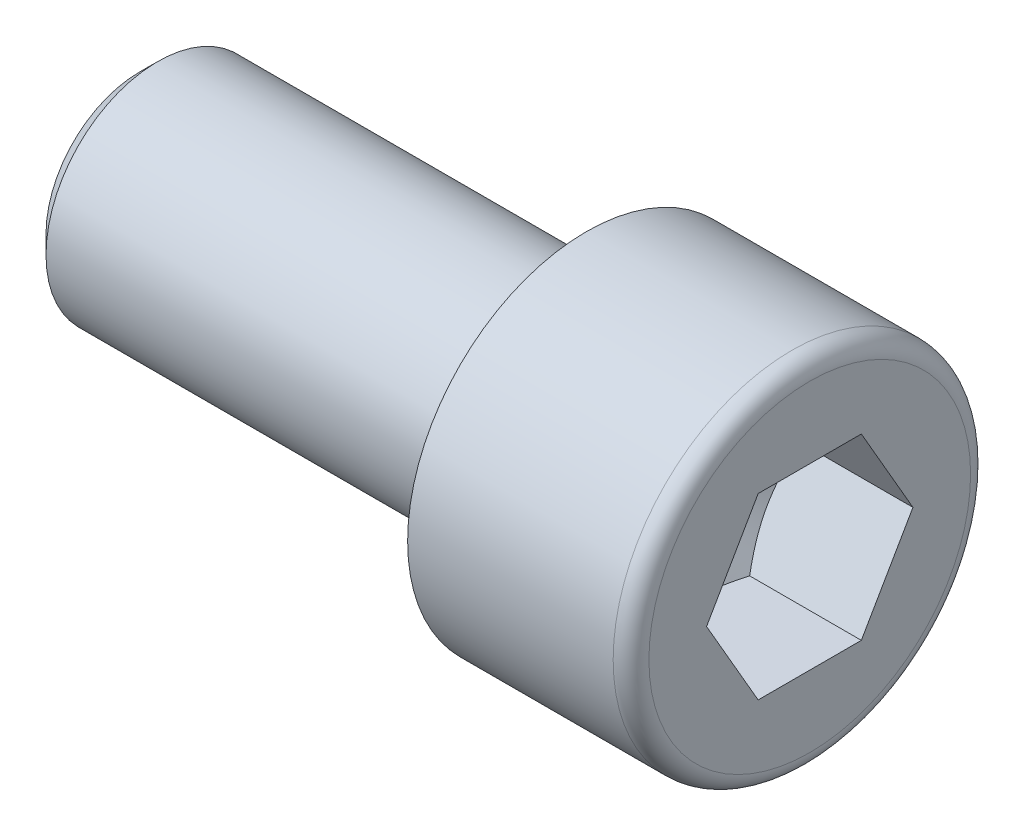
ISO-10303-21;
HEADER;
FILE_DESCRIPTION(('STEP AP214'),'2;1');
FILE_NAME('part.step','',(''),(''),'','','');
FILE_SCHEMA(('AUTOMOTIVE_DESIGN { 1 0 10303 214 1 1 1 1 }'));
ENDSEC;
DATA;
#1=APPLICATION_CONTEXT('core data for automotive mechanical design processes');
#2=APPLICATION_PROTOCOL_DEFINITION('international standard','automotive_design',2000,#1);
#3=PRODUCT_CONTEXT('',#1,'mechanical');
#4=PRODUCT('Part','Part','',(#3));
#5=PRODUCT_RELATED_PRODUCT_CATEGORY('part','',(#4));
#6=PRODUCT_DEFINITION_FORMATION('','',#4);
#7=PRODUCT_DEFINITION_CONTEXT('part definition',#1,'design');
#8=PRODUCT_DEFINITION('design','',#6,#7);
#9=PRODUCT_DEFINITION_SHAPE('','',#8);
#10=(LENGTH_UNIT() NAMED_UNIT(*) SI_UNIT(.MILLI.,.METRE.));
#11=(NAMED_UNIT(*) PLANE_ANGLE_UNIT() SI_UNIT($,.RADIAN.));
#12=(NAMED_UNIT(*) SI_UNIT($,.STERADIAN.) SOLID_ANGLE_UNIT());
#13=UNCERTAINTY_MEASURE_WITH_UNIT(LENGTH_MEASURE(1.E-05),#10,'distance_accuracy_value','');
#14=(GEOMETRIC_REPRESENTATION_CONTEXT(3) GLOBAL_UNCERTAINTY_ASSIGNED_CONTEXT((#13)) GLOBAL_UNIT_ASSIGNED_CONTEXT((#10,
#11,#12)) REPRESENTATION_CONTEXT('',''));
#15=CARTESIAN_POINT('',(0.,0.,0.));
#16=DIRECTION('',(0.,0.,1.));
#17=DIRECTION('',(1.,0.,0.));
#18=AXIS2_PLACEMENT_3D('',#15,#16,#17);
#19=CARTESIAN_POINT('',(-1.,17.,155.));
#20=DIRECTION('',(1.,0.,0.));
#21=DIRECTION('',(0.,0.,1.));
#22=AXIS2_PLACEMENT_3D('',#19,#20,#21);
#23=PLANE('',#22);
#24=CARTESIAN_POINT('',(-1.,17.,155.));
#25=DIRECTION('',(1.,0.,0.));
#26=DIRECTION('',(0.,0.,1.));
#27=AXIS2_PLACEMENT_3D('',#24,#25,#26);
#28=CIRCLE('',#27,7.2);
#29=CARTESIAN_POINT('',(-1.,17.,162.2));
#30=VERTEX_POINT('',#29);
#31=EDGE_CURVE('E11',#30,#30,#28,.T.);
#32=ORIENTED_EDGE('',*,*,#31,.T.);
#33=EDGE_LOOP('',(#32));
#34=FACE_BOUND('',#33,.T.);
#35=DIRECTION('',(0.,0.,1.));
#36=VECTOR('',#35,1.);
#37=CARTESIAN_POINT('',(-1.00000000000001,13.0000018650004,152.6906));
#38=LINE('',#37,#36);
#39=CARTESIAN_POINT('',(-1.00000000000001,13.0000018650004,152.6906));
#40=VERTEX_POINT('',#39);
#41=CARTESIAN_POINT('',(-1.,13.0000018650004,157.3094));
#42=VERTEX_POINT('',#41);
#43=EDGE_CURVE('E91',#40,#42,#38,.T.);
#44=ORIENTED_EDGE('',*,*,#43,.T.);
#45=DIRECTION('',(0.,0.866025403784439,0.5));
#46=VECTOR('',#45,1.);
#47=CARTESIAN_POINT('',(-1.,13.0000018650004,157.3094));
#48=LINE('',#47,#46);
#49=CARTESIAN_POINT('',(-0.999999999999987,17.,159.6188));
#50=VERTEX_POINT('',#49);
#51=EDGE_CURVE('E30',#42,#50,#48,.T.);
#52=ORIENTED_EDGE('',*,*,#51,.T.);
#53=DIRECTION('',(0.,0.866025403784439,-0.5));
#54=VECTOR('',#53,1.);
#55=CARTESIAN_POINT('',(-0.999999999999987,17.,159.6188));
#56=LINE('',#55,#54);
#57=CARTESIAN_POINT('',(-0.999999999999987,20.9999981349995,157.3094));
#58=VERTEX_POINT('',#57);
#59=EDGE_CURVE('E171',#50,#58,#56,.T.);
#60=ORIENTED_EDGE('',*,*,#59,.T.);
#61=DIRECTION('',(0.,0.,-1.));
#62=VECTOR('',#61,1.);
#63=CARTESIAN_POINT('',(-0.999999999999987,20.9999981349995,157.3094));
#64=LINE('',#63,#62);
#65=CARTESIAN_POINT('',(-1.,20.9999981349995,152.6906));
#66=VERTEX_POINT('',#65);
#67=EDGE_CURVE('E167',#58,#66,#64,.T.);
#68=ORIENTED_EDGE('',*,*,#67,.T.);
#69=DIRECTION('',(0.,-0.866025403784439,-0.5));
#70=VECTOR('',#69,1.);
#71=CARTESIAN_POINT('',(-1.,20.9999981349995,152.6906));
#72=LINE('',#71,#70);
#73=CARTESIAN_POINT('',(-1.00000000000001,17.,150.3812));
#74=VERTEX_POINT('',#73);
#75=EDGE_CURVE('E162',#66,#74,#72,.T.);
#76=ORIENTED_EDGE('',*,*,#75,.T.);
#77=DIRECTION('',(0.,-0.866025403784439,0.5));
#78=VECTOR('',#77,1.);
#79=CARTESIAN_POINT('',(-1.00000000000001,17.,150.3812));
#80=LINE('',#79,#78);
#81=EDGE_CURVE('E95',#74,#40,#80,.T.);
#82=ORIENTED_EDGE('',*,*,#81,.T.);
#83=EDGE_LOOP('',(#44,#52,#60,#68,#76,#82));
#84=FACE_BOUND('',#83,.T.);
#85=ADVANCED_FACE('F16',(#34,#84),#23,.T.);
#86=CARTESIAN_POINT('',(-1.8,17.,155.));
#87=DIRECTION('',(1.,0.,0.));
#88=DIRECTION('',(0.,0.,1.));
#89=AXIS2_PLACEMENT_3D('',#86,#87,#88);
#90=TOROIDAL_SURFACE('',#89,7.2,0.8);
#91=ORIENTED_EDGE('',*,*,#31,.F.);
#92=EDGE_LOOP('',(#91));
#93=FACE_BOUND('',#92,.T.);
#94=CARTESIAN_POINT('',(-1.8,17.,155.));
#95=DIRECTION('',(1.,0.,0.));
#96=DIRECTION('',(0.,0.,1.));
#97=AXIS2_PLACEMENT_3D('',#94,#95,#96);
#98=CIRCLE('',#97,8.);
#99=CARTESIAN_POINT('',(-1.8,17.,163.));
#100=VERTEX_POINT('',#99);
#101=EDGE_CURVE('E23',#100,#100,#98,.T.);
#102=ORIENTED_EDGE('',*,*,#101,.T.);
#103=EDGE_LOOP('',(#102));
#104=FACE_BOUND('',#103,.T.);
#105=ADVANCED_FACE('F132',(#93,#104),#90,.T.);
#106=CARTESIAN_POINT('',(-1.,17.,155.));
#107=DIRECTION('',(1.,0.,0.));
#108=DIRECTION('',(0.,0.,1.));
#109=AXIS2_PLACEMENT_3D('',#106,#107,#108);
#110=CYLINDRICAL_SURFACE('',#109,8.);
#111=CARTESIAN_POINT('',(-11.,17.,155.));
#112=DIRECTION('',(1.,0.,0.));
#113=DIRECTION('',(0.,0.,1.));
#114=AXIS2_PLACEMENT_3D('',#111,#112,#113);
#115=CIRCLE('',#114,8.);
#116=CARTESIAN_POINT('',(-11.,17.,163.));
#117=VERTEX_POINT('',#116);
#118=EDGE_CURVE('E127',#117,#117,#115,.T.);
#119=ORIENTED_EDGE('',*,*,#118,.T.);
#120=EDGE_LOOP('',(#119));
#121=FACE_BOUND('',#120,.T.);
#122=ORIENTED_EDGE('',*,*,#101,.F.);
#123=EDGE_LOOP('',(#122));
#124=FACE_BOUND('',#123,.T.);
#125=ADVANCED_FACE('F134',(#121,#124),#110,.T.);
#126=CARTESIAN_POINT('',(-11.,9.00000000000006,155.));
#127=DIRECTION('',(-1.,0.,0.));
#128=DIRECTION('',(0.,0.,-1.));
#129=AXIS2_PLACEMENT_3D('',#126,#127,#128);
#130=PLANE('',#129);
#131=CARTESIAN_POINT('',(-11.,17.,155.));
#132=DIRECTION('',(1.,0.,0.));
#133=DIRECTION('',(0.,0.,1.));
#134=AXIS2_PLACEMENT_3D('',#131,#132,#133);
#135=CIRCLE('',#134,5.5);
#136=CARTESIAN_POINT('',(-11.,17.,160.5));
#137=VERTEX_POINT('',#136);
#138=EDGE_CURVE('E124',#137,#137,#135,.T.);
#139=ORIENTED_EDGE('',*,*,#138,.T.);
#140=EDGE_LOOP('',(#139));
#141=FACE_BOUND('',#140,.T.);
#142=ORIENTED_EDGE('',*,*,#118,.F.);
#143=EDGE_LOOP('',(#142));
#144=FACE_BOUND('',#143,.T.);
#145=ADVANCED_FACE('F136',(#141,#144),#130,.T.);
#146=CARTESIAN_POINT('',(-11.5,17.,155.));
#147=DIRECTION('',(1.,0.,0.));
#148=DIRECTION('',(0.,0.,1.));
#149=AXIS2_PLACEMENT_3D('',#146,#147,#148);
#150=TOROIDAL_SURFACE('',#149,5.5,0.5);
#151=CARTESIAN_POINT('',(-11.5,17.,155.));
#152=DIRECTION('',(1.,0.,0.));
#153=DIRECTION('',(0.,0.,1.));
#154=AXIS2_PLACEMENT_3D('',#151,#152,#153);
#155=CIRCLE('',#154,5.);
#156=CARTESIAN_POINT('',(-11.5,17.,160.));
#157=VERTEX_POINT('',#156);
#158=EDGE_CURVE('E121',#157,#157,#155,.T.);
#159=ORIENTED_EDGE('',*,*,#158,.T.);
#160=EDGE_LOOP('',(#159));
#161=FACE_BOUND('',#160,.T.);
#162=ORIENTED_EDGE('',*,*,#138,.F.);
#163=EDGE_LOOP('',(#162));
#164=FACE_BOUND('',#163,.T.);
#165=ADVANCED_FACE('F144',(#161,#164),#150,.F.);
#166=CARTESIAN_POINT('',(-1.,17.,155.));
#167=DIRECTION('',(1.,0.,0.));
#168=DIRECTION('',(0.,0.,1.));
#169=AXIS2_PLACEMENT_3D('',#166,#167,#168);
#170=CYLINDRICAL_SURFACE('',#169,5.);
#171=CARTESIAN_POINT('',(-11.501,17.,155.));
#172=DIRECTION('',(1.,0.,0.));
#173=DIRECTION('',(0.,0.,1.));
#174=AXIS2_PLACEMENT_3D('',#171,#172,#173);
#175=CIRCLE('',#174,5.);
#176=CARTESIAN_POINT('',(-11.501,17.,160.));
#177=VERTEX_POINT('',#176);
#178=EDGE_CURVE('E118',#177,#177,#175,.T.);
#179=ORIENTED_EDGE('',*,*,#178,.T.);
#180=EDGE_LOOP('',(#179));
#181=FACE_BOUND('',#180,.T.);
#182=ORIENTED_EDGE('',*,*,#158,.F.);
#183=EDGE_LOOP('',(#182));
#184=FACE_BOUND('',#183,.T.);
#185=ADVANCED_FACE('F284',(#181,#184),#170,.T.);
#186=CARTESIAN_POINT('',(-11.501,17.,155.));
#187=DIRECTION('',(1.,0.,0.));
#188=DIRECTION('',(0.,0.,1.));
#189=AXIS2_PLACEMENT_3D('',#186,#187,#188);
#190=CONICAL_SURFACE('',#189,5.,0.523598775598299);
#191=CARTESIAN_POINT('',(-12.907208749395,17.,155.));
#192=DIRECTION('',(1.,0.,0.));
#193=DIRECTION('',(0.,0.,1.));
#194=AXIS2_PLACEMENT_3D('',#191,#192,#193);
#195=CIRCLE('',#194,4.188125);
#196=CARTESIAN_POINT('',(-12.907208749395,17.,159.188125));
#197=VERTEX_POINT('',#196);
#198=EDGE_CURVE('E115',#197,#197,#195,.T.);
#199=ORIENTED_EDGE('',*,*,#198,.T.);
#200=EDGE_LOOP('',(#199));
#201=FACE_BOUND('',#200,.T.);
#202=ORIENTED_EDGE('',*,*,#178,.F.);
#203=EDGE_LOOP('',(#202));
#204=FACE_BOUND('',#203,.T.);
#205=ADVANCED_FACE('F276',(#201,#204),#190,.T.);
#206=CARTESIAN_POINT('',(-12.907208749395,12.811875,155.));
#207=DIRECTION('',(1.,0.,0.));
#208=DIRECTION('',(0.,0.,1.));
#209=AXIS2_PLACEMENT_3D('',#206,#207,#208);
#210=PLANE('',#209);
#211=CARTESIAN_POINT('',(-12.907208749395,17.,155.));
#212=DIRECTION('',(1.,0.,0.));
#213=DIRECTION('',(0.,0.,1.));
#214=AXIS2_PLACEMENT_3D('',#211,#212,#213);
#215=CIRCLE('',#214,5.);
#216=CARTESIAN_POINT('',(-12.907208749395,17.,160.));
#217=VERTEX_POINT('',#216);
#218=EDGE_CURVE('E112',#217,#217,#215,.T.);
#219=ORIENTED_EDGE('',*,*,#218,.T.);
#220=EDGE_LOOP('',(#219));
#221=FACE_BOUND('',#220,.T.);
#222=ORIENTED_EDGE('',*,*,#198,.F.);
#223=EDGE_LOOP('',(#222));
#224=FACE_BOUND('',#223,.T.);
#225=ADVANCED_FACE('F268',(#221,#224),#210,.T.);
#226=CARTESIAN_POINT('',(-1.,17.,155.));
#227=DIRECTION('',(1.,0.,0.));
#228=DIRECTION('',(0.,0.,1.));
#229=AXIS2_PLACEMENT_3D('',#226,#227,#228);
#230=CYLINDRICAL_SURFACE('',#229,5.);
#231=CARTESIAN_POINT('',(-30.188125,17.,155.));
#232=DIRECTION('',(1.,0.,0.));
#233=DIRECTION('',(0.,0.,1.));
#234=AXIS2_PLACEMENT_3D('',#231,#232,#233);
#235=CIRCLE('',#234,5.);
#236=CARTESIAN_POINT('',(-30.188125,17.,160.));
#237=VERTEX_POINT('',#236);
#238=EDGE_CURVE('E109',#237,#237,#235,.T.);
#239=ORIENTED_EDGE('',*,*,#238,.T.);
#240=EDGE_LOOP('',(#239));
#241=FACE_BOUND('',#240,.T.);
#242=ORIENTED_EDGE('',*,*,#218,.F.);
#243=EDGE_LOOP('',(#242));
#244=FACE_BOUND('',#243,.T.);
#245=ADVANCED_FACE('F260',(#241,#244),#230,.T.);
#246=CARTESIAN_POINT('',(-30.188125,17.,155.));
#247=DIRECTION('',(1.,0.,0.));
#248=DIRECTION('',(0.,0.,1.));
#249=AXIS2_PLACEMENT_3D('',#246,#247,#248);
#250=CONICAL_SURFACE('',#249,5.,0.785398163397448);
#251=CARTESIAN_POINT('',(-31.,17.,155.));
#252=DIRECTION('',(1.,0.,0.));
#253=DIRECTION('',(0.,0.,1.));
#254=AXIS2_PLACEMENT_3D('',#251,#252,#253);
#255=CIRCLE('',#254,4.188125);
#256=CARTESIAN_POINT('',(-31.,17.,159.188125));
#257=VERTEX_POINT('',#256);
#258=EDGE_CURVE('E106',#257,#257,#255,.T.);
#259=ORIENTED_EDGE('',*,*,#258,.T.);
#260=EDGE_LOOP('',(#259));
#261=FACE_BOUND('',#260,.T.);
#262=ORIENTED_EDGE('',*,*,#238,.F.);
#263=EDGE_LOOP('',(#262));
#264=FACE_BOUND('',#263,.T.);
#265=ADVANCED_FACE('F253',(#261,#264),#250,.T.);
#266=CARTESIAN_POINT('',(-31.,12.811875,155.));
#267=DIRECTION('',(-1.,0.,0.));
#268=DIRECTION('',(0.,0.,-1.));
#269=AXIS2_PLACEMENT_3D('',#266,#267,#268);
#270=PLANE('',#269);
#271=ORIENTED_EDGE('',*,*,#258,.F.);
#272=EDGE_LOOP('',(#271));
#273=FACE_BOUND('',#272,.T.);
#274=ADVANCED_FACE('F227',(#273),#270,.T.);
#275=CARTESIAN_POINT('',(-8.66666542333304,13.0000018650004,157.3094));
#276=DIRECTION('',(0.,0.5,-0.866025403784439));
#277=DIRECTION('',(0.,-0.866025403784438,-0.5));
#278=AXIS2_PLACEMENT_3D('',#275,#276,#277);
#279=PLANE('',#278);
#280=DIRECTION('',(1.,0.,0.));
#281=VECTOR('',#280,1.);
#282=CARTESIAN_POINT('',(-8.66666542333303,17.0000000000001,159.6188));
#283=LINE('',#282,#281);
#284=CARTESIAN_POINT('',(-5.99999999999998,17.,159.6188));
#285=VERTEX_POINT('',#284);
#286=EDGE_CURVE('E104',#285,#50,#283,.T.);
#287=ORIENTED_EDGE('',*,*,#286,.T.);
#288=ORIENTED_EDGE('',*,*,#51,.F.);
#289=DIRECTION('',(1.,0.,0.));
#290=VECTOR('',#289,1.);
#291=CARTESIAN_POINT('',(-8.66666542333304,13.0000018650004,157.3094));
#292=LINE('',#291,#290);
#293=CARTESIAN_POINT('',(-6.,13.0000018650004,157.3094));
#294=VERTEX_POINT('',#293);
#295=EDGE_CURVE('E85',#294,#42,#292,.T.);
#296=ORIENTED_EDGE('',*,*,#295,.F.);
#297=CARTESIAN_POINT('',(-5.99999993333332,17.0000002,159.61880011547));
#298=CARTESIAN_POINT('',(-6.05860882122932,16.8242245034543,159.517315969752));
#299=CARTESIAN_POINT('',(-6.11191053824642,16.6469315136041,159.414955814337));
#300=CARTESIAN_POINT('',(-6.20494708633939,16.2892758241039,159.208463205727));
#301=CARTESIAN_POINT('',(-6.24464900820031,16.1089067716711,159.104327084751));
#302=CARTESIAN_POINT('',(-6.30644791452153,15.7504038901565,158.897345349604));
#303=CARTESIAN_POINT('',(-6.3289562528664,15.5723252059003,158.794531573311));
#304=CARTESIAN_POINT('',(-6.35582149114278,15.2153303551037,158.588420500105));
#305=CARTESIAN_POINT('',(-6.36020064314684,15.0364154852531,158.485123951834));
#306=CARTESIAN_POINT('',(-6.351067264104,14.7021322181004,158.292125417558));
#307=CARTESIAN_POINT('',(-6.33979728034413,14.5467136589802,158.202394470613));
#308=CARTESIAN_POINT('',(-6.30408526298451,14.2368890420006,158.023517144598));
#309=CARTESIAN_POINT('',(-6.27963104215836,14.0824840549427,157.934371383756));
#310=CARTESIAN_POINT('',(-6.21850022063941,13.7720211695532,157.755125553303));
#311=CARTESIAN_POINT('',(-6.18156461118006,13.6160025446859,157.665048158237));
#312=CARTESIAN_POINT('',(-6.09773639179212,13.3062916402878,157.486236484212));
#313=CARTESIAN_POINT('',(-6.05086346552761,13.1525953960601,157.397499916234));
#314=CARTESIAN_POINT('',(-5.99999993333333,13.0000016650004,157.30939988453));
#315=B_SPLINE_CURVE_WITH_KNOTS('',3,(#297,#298,#299,#300,#301,#302,#303,#304,#305,#306,#307,
#308,#309,#310,#311,#312,#313,#314),.UNSPECIFIED.,.F.,.F.,(4,2,2,2,2,2,2,2,4),(0.,
0.634031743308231,1.2695870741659,1.88941437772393,2.50848066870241,3.04741430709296,
3.58684698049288,4.13824168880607,4.68855424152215),.UNSPECIFIED.);
#316=EDGE_CURVE('E78',#285,#294,#315,.T.);
#317=ORIENTED_EDGE('',*,*,#316,.F.);
#318=EDGE_LOOP('',(#287,#288,#296,#317));
#319=FACE_BOUND('',#318,.T.);
#320=ADVANCED_FACE('F86',(#319),#279,.T.);
#321=CARTESIAN_POINT('',(-8.66666542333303,17.0000000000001,159.6188));
#322=DIRECTION('',(0.,-0.5,-0.866025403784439));
#323=DIRECTION('',(0.,-0.866025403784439,0.5));
#324=AXIS2_PLACEMENT_3D('',#321,#322,#323);
#325=PLANE('',#324);
#326=DIRECTION('',(1.,0.,0.));
#327=VECTOR('',#326,1.);
#328=CARTESIAN_POINT('',(-8.66666542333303,20.9999981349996,157.3094));
#329=LINE('',#328,#327);
#330=CARTESIAN_POINT('',(-5.99999999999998,20.9999981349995,157.3094));
#331=VERTEX_POINT('',#330);
#332=EDGE_CURVE('E102',#331,#58,#329,.T.);
#333=ORIENTED_EDGE('',*,*,#332,.T.);
#334=ORIENTED_EDGE('',*,*,#59,.F.);
#335=ORIENTED_EDGE('',*,*,#286,.F.);
#336=CARTESIAN_POINT('',(-5.99999993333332,20.9999983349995,157.30939988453));
#337=CARTESIAN_POINT('',(-6.05860882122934,20.8242226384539,157.410884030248));
#338=CARTESIAN_POINT('',(-6.11191053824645,20.6469296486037,157.513244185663));
#339=CARTESIAN_POINT('',(-6.20494708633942,20.2892739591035,157.719736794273));
#340=CARTESIAN_POINT('',(-6.24464900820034,20.1089049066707,157.823872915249));
#341=CARTESIAN_POINT('',(-6.30644791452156,19.7504020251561,158.030854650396));
#342=CARTESIAN_POINT('',(-6.32895625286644,19.5723233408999,158.133668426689));
#343=CARTESIAN_POINT('',(-6.35582149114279,19.2153284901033,158.339779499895));
#344=CARTESIAN_POINT('',(-6.36020064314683,19.0364136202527,158.443076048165));
#345=CARTESIAN_POINT('',(-6.351067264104,18.7021303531,158.636074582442));
#346=CARTESIAN_POINT('',(-6.33979728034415,18.5467117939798,158.725805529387));
#347=CARTESIAN_POINT('',(-6.30408526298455,18.2368871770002,158.904682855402));
#348=CARTESIAN_POINT('',(-6.2796310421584,18.0824821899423,158.993828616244));
#349=CARTESIAN_POINT('',(-6.21850022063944,17.7720193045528,159.173074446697));
#350=CARTESIAN_POINT('',(-6.18156461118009,17.6160006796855,159.263151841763));
#351=CARTESIAN_POINT('',(-6.09773639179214,17.3062897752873,159.441963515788));
#352=CARTESIAN_POINT('',(-6.05086346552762,17.1525935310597,159.530700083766));
#353=CARTESIAN_POINT('',(-5.99999993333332,16.9999997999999,159.61880011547));
#354=B_SPLINE_CURVE_WITH_KNOTS('',3,(#336,#337,#338,#339,#340,#341,#342,#343,#344,#345,#346,
#347,#348,#349,#350,#351,#352,#353),.UNSPECIFIED.,.F.,.F.,(4,2,2,2,2,2,2,2,4),(0.,
0.634031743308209,1.26958707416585,1.88941437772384,2.50848066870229,3.04741430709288,
3.58684698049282,4.13824168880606,4.68855424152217),.UNSPECIFIED.);
#355=EDGE_CURVE('E82',#331,#285,#354,.T.);
#356=ORIENTED_EDGE('',*,*,#355,.F.);
#357=EDGE_LOOP('',(#333,#334,#335,#356));
#358=FACE_BOUND('',#357,.T.);
#359=ADVANCED_FACE('F217',(#358),#325,.T.);
#360=CARTESIAN_POINT('',(-8.66666542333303,20.9999981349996,157.3094));
#361=DIRECTION('',(0.,-1.,0.));
#362=DIRECTION('',(0.,0.,1.));
#363=AXIS2_PLACEMENT_3D('',#360,#361,#362);
#364=PLANE('',#363);
#365=DIRECTION('',(1.,0.,0.));
#366=VECTOR('',#365,1.);
#367=CARTESIAN_POINT('',(-8.66666542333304,20.9999981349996,152.6906));
#368=LINE('',#367,#366);
#369=CARTESIAN_POINT('',(-6.,20.9999981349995,152.6906));
#370=VERTEX_POINT('',#369);
#371=EDGE_CURVE('E100',#370,#66,#368,.T.);
#372=ORIENTED_EDGE('',*,*,#371,.T.);
#373=ORIENTED_EDGE('',*,*,#67,.F.);
#374=ORIENTED_EDGE('',*,*,#332,.F.);
#375=CARTESIAN_POINT('',(-4.51265953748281,20.9999981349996,149.01942230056));
#376=CARTESIAN_POINT('',(-4.59553062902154,20.9999981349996,149.192155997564));
#377=CARTESIAN_POINT('',(-4.67754095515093,20.9999981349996,149.365310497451));
#378=CARTESIAN_POINT('',(-4.83935177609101,20.9999981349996,149.712685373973));
#379=CARTESIAN_POINT('',(-4.91915187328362,20.9999981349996,149.886905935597));
#380=CARTESIAN_POINT('',(-5.07649974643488,20.9999981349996,150.237636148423));
#381=CARTESIAN_POINT('',(-5.15403092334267,20.9999981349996,150.414153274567));
#382=CARTESIAN_POINT('',(-5.30561658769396,20.9999981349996,150.768668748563));
#383=CARTESIAN_POINT('',(-5.37967125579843,20.9999981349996,150.946667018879));
#384=CARTESIAN_POINT('',(-5.52526388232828,20.9999981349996,151.30911671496));
#385=CARTESIAN_POINT('',(-5.59668541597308,20.9999981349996,151.493615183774));
#386=CARTESIAN_POINT('',(-5.73359043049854,20.9999981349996,151.864843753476));
#387=CARTESIAN_POINT('',(-5.79907322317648,20.9999981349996,152.051574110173));
#388=CARTESIAN_POINT('',(-5.92223088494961,20.9999981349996,152.42714051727));
#389=CARTESIAN_POINT('',(-5.97992348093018,20.9999981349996,152.615970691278));
#390=CARTESIAN_POINT('',(-6.08551950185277,20.9999981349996,152.996320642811));
#391=CARTESIAN_POINT('',(-6.13342621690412,20.9999981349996,153.187839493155));
#392=CARTESIAN_POINT('',(-6.21690509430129,20.9999981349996,153.573192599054));
#393=CARTESIAN_POINT('',(-6.25250205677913,20.9999981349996,153.767021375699));
#394=CARTESIAN_POINT('',(-6.30902756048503,20.9999981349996,154.156847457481));
#395=CARTESIAN_POINT('',(-6.32995709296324,20.9999981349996,154.352844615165));
#396=CARTESIAN_POINT('',(-6.35520588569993,20.9999981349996,154.743573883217));
#397=CARTESIAN_POINT('',(-6.35972115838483,20.9999981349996,154.938293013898));
#398=CARTESIAN_POINT('',(-6.35226257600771,20.9999981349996,155.327426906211));
#399=CARTESIAN_POINT('',(-6.34028769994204,20.9999981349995,155.52184164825));
#400=CARTESIAN_POINT('',(-6.30608090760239,20.9999981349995,155.85849173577));
#401=CARTESIAN_POINT('',(-6.2873428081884,20.9999981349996,156.00109922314));
#402=CARTESIAN_POINT('',(-6.24228330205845,20.9999981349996,156.285119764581));
#403=CARTESIAN_POINT('',(-6.21596067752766,20.9999981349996,156.426532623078));
#404=CARTESIAN_POINT('',(-6.12701633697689,20.9999981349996,156.848869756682));
#405=CARTESIAN_POINT('',(-6.05443869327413,20.9999981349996,157.127712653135));
#406=CARTESIAN_POINT('',(-5.93045460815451,20.9999981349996,157.544632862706));
#407=CARTESIAN_POINT('',(-5.88603482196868,20.9999981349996,157.68490831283));
#408=CARTESIAN_POINT('',(-5.79305928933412,20.9999981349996,157.964095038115));
#409=CARTESIAN_POINT('',(-5.74450351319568,20.9999981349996,158.103006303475));
#410=CARTESIAN_POINT('',(-5.64399512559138,20.9999981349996,158.379520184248));
#411=CARTESIAN_POINT('',(-5.59204388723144,20.9999981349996,158.517123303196));
#412=CARTESIAN_POINT('',(-5.48530773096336,20.9999981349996,158.791220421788));
#413=CARTESIAN_POINT('',(-5.43052285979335,20.9999981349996,158.927714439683));
#414=CARTESIAN_POINT('',(-5.28716685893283,20.9999981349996,159.276131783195));
#415=CARTESIAN_POINT('',(-5.19690336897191,20.9999981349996,159.487357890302));
#416=CARTESIAN_POINT('',(-5.01203406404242,20.9999981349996,159.907907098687));
#417=CARTESIAN_POINT('',(-4.91742792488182,20.9999981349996,160.117230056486));
#418=CARTESIAN_POINT('',(-4.72485320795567,20.9999981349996,160.534379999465));
#419=CARTESIAN_POINT('',(-4.62688383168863,20.9999981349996,160.742206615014));
#420=CARTESIAN_POINT('',(-4.42832859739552,20.9999981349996,161.156608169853));
#421=CARTESIAN_POINT('',(-4.32774268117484,20.9999981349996,161.363183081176));
#422=CARTESIAN_POINT('',(-4.02266766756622,20.9999981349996,161.981872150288));
#423=CARTESIAN_POINT('',(-3.81509025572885,20.9999981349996,162.392462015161));
#424=CARTESIAN_POINT('',(-3.394630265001,20.9999981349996,163.210823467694));
#425=CARTESIAN_POINT('',(-3.18174845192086,20.9999981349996,163.618595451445));
#426=CARTESIAN_POINT('',(-2.77256649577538,20.9999981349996,164.393798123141));
#427=CARTESIAN_POINT('',(-2.57659763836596,20.9999981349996,164.761403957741));
#428=CARTESIAN_POINT('',(-2.18242772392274,20.9999981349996,165.495435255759));
#429=CARTESIAN_POINT('',(-1.98422657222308,20.9999981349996,165.861860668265));
#430=CARTESIAN_POINT('',(-1.58665718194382,20.9999981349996,166.592869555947));
#431=CARTESIAN_POINT('',(-1.38729319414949,20.9999981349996,166.95745534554));
#432=CARTESIAN_POINT('',(-0.98726871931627,20.9999981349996,167.685887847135));
#433=CARTESIAN_POINT('',(-0.786608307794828,20.9999981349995,168.049734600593));
#434=CARTESIAN_POINT('',(-0.585472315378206,20.9999981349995,168.413316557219));
#435=B_SPLINE_CURVE_WITH_KNOTS('',3,(#375,#376,#377,#378,#379,#380,#381,#382,#383,#384,#385,
#386,#387,#388,#389,#390,#391,#392,#393,#394,#395,#396,#397,#398,#399,#400,#401,#402,#403,#404,
#405,#406,#407,#408,#409,#410,#411,#412,#413,#414,#415,#416,#417,#418,#419,#420,#421,#422,#423,
#424,#425,#426,#427,#428,#429,#430,#431,#432,#433,#434),.UNSPECIFIED.,.F.,.F.,(4,2,2,2,2,2,2,2,
2,2,2,2,2,2,2,2,2,2,2,2,2,2,2,2,2,2,2,2,2,4),(0.,0.574761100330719,1.14962493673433,
1.72797591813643,2.30629681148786,2.89973831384,3.49324849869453,4.08538451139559,
4.67732111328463,5.2680581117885,5.85875518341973,6.44237478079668,7.02603051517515,
7.45731714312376,7.88867305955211,8.75192580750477,9.19331611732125,9.63470959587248,
10.0759256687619,10.517134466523,11.206176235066,11.8952695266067,12.5845275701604,
13.2738009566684,14.6539662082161,16.0339333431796,17.2836591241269,18.5334381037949,
19.7800382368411,21.0265663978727),.UNSPECIFIED.);
#436=EDGE_CURVE('E209',#370,#331,#435,.T.);
#437=ORIENTED_EDGE('',*,*,#436,.F.);
#438=EDGE_LOOP('',(#372,#373,#374,#437));
#439=FACE_BOUND('',#438,.T.);
#440=ADVANCED_FACE('F214',(#439),#364,.T.);
#441=CARTESIAN_POINT('',(-8.66666542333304,20.9999981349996,152.6906));
#442=DIRECTION('',(0.,-0.5,0.866025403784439));
#443=DIRECTION('',(0.,0.866025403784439,0.5));
#444=AXIS2_PLACEMENT_3D('',#441,#442,#443);
#445=PLANE('',#444);
#446=DIRECTION('',(1.,0.,0.));
#447=VECTOR('',#446,1.);
#448=CARTESIAN_POINT('',(-8.66666542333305,17.0000000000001,150.3812));
#449=LINE('',#448,#447);
#450=CARTESIAN_POINT('',(-6.00000000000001,17.,150.3812));
#451=VERTEX_POINT('',#450);
#452=EDGE_CURVE('E93',#451,#74,#449,.T.);
#453=ORIENTED_EDGE('',*,*,#452,.T.);
#454=ORIENTED_EDGE('',*,*,#75,.F.);
#455=ORIENTED_EDGE('',*,*,#371,.F.);
#456=CARTESIAN_POINT('',(-5.99999993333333,16.9999998,150.38119988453));
#457=CARTESIAN_POINT('',(-6.05860882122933,17.1757754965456,150.482684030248));
#458=CARTESIAN_POINT('',(-6.11191053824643,17.3530684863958,150.585044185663));
#459=CARTESIAN_POINT('',(-6.2049470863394,17.710724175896,150.791536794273));
#460=CARTESIAN_POINT('',(-6.24464900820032,17.8910932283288,150.895672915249));
#461=CARTESIAN_POINT('',(-6.30644791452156,18.2495961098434,151.102654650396));
#462=CARTESIAN_POINT('',(-6.32895625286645,18.4276747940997,151.205468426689));
#463=CARTESIAN_POINT('',(-6.3558214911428,18.7846696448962,151.411579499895));
#464=CARTESIAN_POINT('',(-6.36020064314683,18.9635845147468,151.514876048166));
#465=CARTESIAN_POINT('',(-6.351067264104,19.2978677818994,151.707874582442));
#466=CARTESIAN_POINT('',(-6.33979728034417,19.4532863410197,151.797605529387));
#467=CARTESIAN_POINT('',(-6.30408526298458,19.7631109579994,151.976482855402));
#468=CARTESIAN_POINT('',(-6.27963104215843,19.9175159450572,152.065628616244));
#469=CARTESIAN_POINT('',(-6.21850022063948,20.2279788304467,152.244874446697));
#470=CARTESIAN_POINT('',(-6.18156461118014,20.383997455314,152.334951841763));
#471=CARTESIAN_POINT('',(-6.09773639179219,20.6937083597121,152.513763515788));
#472=CARTESIAN_POINT('',(-6.05086346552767,20.8474046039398,152.602500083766));
#473=CARTESIAN_POINT('',(-5.99999993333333,20.9999983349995,152.69060011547));
#474=B_SPLINE_CURVE_WITH_KNOTS('',3,(#456,#457,#458,#459,#460,#461,#462,#463,#464,#465,#466,
#467,#468,#469,#470,#471,#472,#473),.UNSPECIFIED.,.F.,.F.,(4,2,2,2,2,2,2,2,4),(0.,
0.634031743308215,1.26958707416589,1.88941437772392,2.50848066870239,3.04741430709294,
3.58684698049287,4.13824168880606,4.68855424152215),.UNSPECIFIED.);
#475=EDGE_CURVE('E204',#451,#370,#474,.T.);
#476=ORIENTED_EDGE('',*,*,#475,.F.);
#477=EDGE_LOOP('',(#453,#454,#455,#476));
#478=FACE_BOUND('',#477,.T.);
#479=ADVANCED_FACE('F216',(#478),#445,.T.);
#480=CARTESIAN_POINT('',(-8.66666542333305,17.0000000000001,150.3812));
#481=DIRECTION('',(0.,0.5,0.866025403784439));
#482=DIRECTION('',(0.,0.866025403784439,-0.5));
#483=AXIS2_PLACEMENT_3D('',#480,#481,#482);
#484=PLANE('',#483);
#485=DIRECTION('',(1.,0.,0.));
#486=VECTOR('',#485,1.);
#487=CARTESIAN_POINT('',(-8.66666542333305,13.0000018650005,152.6906));
#488=LINE('',#487,#486);
#489=CARTESIAN_POINT('',(-6.00000000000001,13.0000018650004,152.6906));
#490=VERTEX_POINT('',#489);
#491=EDGE_CURVE('E90',#490,#40,#488,.T.);
#492=ORIENTED_EDGE('',*,*,#491,.T.);
#493=ORIENTED_EDGE('',*,*,#81,.F.);
#494=ORIENTED_EDGE('',*,*,#452,.F.);
#495=CARTESIAN_POINT('',(-5.99999993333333,13.0000016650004,152.69060011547));
#496=CARTESIAN_POINT('',(-6.0586088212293,13.1757773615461,152.589115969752));
#497=CARTESIAN_POINT('',(-6.11191053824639,13.3530703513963,152.486755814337));
#498=CARTESIAN_POINT('',(-6.20494708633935,13.7107260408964,152.280263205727));
#499=CARTESIAN_POINT('',(-6.24464900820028,13.8910950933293,152.176127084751));
#500=CARTESIAN_POINT('',(-6.3064479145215,14.2495979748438,151.969145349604));
#501=CARTESIAN_POINT('',(-6.32895625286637,14.4276766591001,151.866331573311));
#502=CARTESIAN_POINT('',(-6.35582149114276,14.7846715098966,151.660220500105));
#503=CARTESIAN_POINT('',(-6.36020064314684,14.9635863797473,151.556923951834));
#504=CARTESIAN_POINT('',(-6.35106726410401,15.2978696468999,151.363925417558));
#505=CARTESIAN_POINT('',(-6.33979728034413,15.4532882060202,151.274194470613));
#506=CARTESIAN_POINT('',(-6.30408526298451,15.7631128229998,151.095317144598));
#507=CARTESIAN_POINT('',(-6.27963104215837,15.9175178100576,151.006171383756));
#508=CARTESIAN_POINT('',(-6.21850022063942,16.2279806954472,150.826925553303));
#509=CARTESIAN_POINT('',(-6.18156461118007,16.3839993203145,150.736848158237));
#510=CARTESIAN_POINT('',(-6.09773639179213,16.6937102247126,150.558036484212));
#511=CARTESIAN_POINT('',(-6.05086346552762,16.8474064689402,150.469299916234));
#512=CARTESIAN_POINT('',(-5.99999993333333,17.0000002,150.38119988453));
#513=B_SPLINE_CURVE_WITH_KNOTS('',3,(#495,#496,#497,#498,#499,#500,#501,#502,#503,#504,#505,
#506,#507,#508,#509,#510,#511,#512),.UNSPECIFIED.,.F.,.F.,(4,2,2,2,2,2,2,2,4),(0.,
0.634031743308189,1.26958707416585,1.88941437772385,2.50848066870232,3.04741430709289,
3.58684698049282,4.13824168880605,4.68855424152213),.UNSPECIFIED.);
#514=EDGE_CURVE('E38',#490,#451,#513,.T.);
#515=ORIENTED_EDGE('',*,*,#514,.F.);
#516=EDGE_LOOP('',(#492,#493,#494,#515));
#517=FACE_BOUND('',#516,.T.);
#518=ADVANCED_FACE('F161',(#517),#484,.T.);
#519=CARTESIAN_POINT('',(-8.66666542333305,13.0000018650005,152.6906));
#520=DIRECTION('',(0.,1.,0.));
#521=DIRECTION('',(0.,0.,-1.));
#522=AXIS2_PLACEMENT_3D('',#519,#520,#521);
#523=PLANE('',#522);
#524=ORIENTED_EDGE('',*,*,#295,.T.);
#525=ORIENTED_EDGE('',*,*,#43,.F.);
#526=ORIENTED_EDGE('',*,*,#491,.F.);
#527=CARTESIAN_POINT('',(-4.51265953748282,13.0000018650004,149.01942230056));
#528=CARTESIAN_POINT('',(-4.59553062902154,13.0000018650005,149.192155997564));
#529=CARTESIAN_POINT('',(-4.67754095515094,13.0000018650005,149.365310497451));
#530=CARTESIAN_POINT('',(-4.83935177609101,13.0000018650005,149.712685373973));
#531=CARTESIAN_POINT('',(-4.91915187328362,13.0000018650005,149.886905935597));
#532=CARTESIAN_POINT('',(-5.07649974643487,13.0000018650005,150.237636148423));
#533=CARTESIAN_POINT('',(-5.15403092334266,13.0000018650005,150.414153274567));
#534=CARTESIAN_POINT('',(-5.30561658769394,13.0000018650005,150.768668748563));
#535=CARTESIAN_POINT('',(-5.37967125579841,13.0000018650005,150.946667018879));
#536=CARTESIAN_POINT('',(-5.52526388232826,13.0000018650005,151.30911671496));
#537=CARTESIAN_POINT('',(-5.59668541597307,13.0000018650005,151.493615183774));
#538=CARTESIAN_POINT('',(-5.73359043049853,13.0000018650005,151.864843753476));
#539=CARTESIAN_POINT('',(-5.79907322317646,13.0000018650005,152.051574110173));
#540=CARTESIAN_POINT('',(-5.92223088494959,13.0000018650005,152.42714051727));
#541=CARTESIAN_POINT('',(-5.97992348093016,13.0000018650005,152.615970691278));
#542=CARTESIAN_POINT('',(-6.08551950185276,13.0000018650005,152.996320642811));
#543=CARTESIAN_POINT('',(-6.13342621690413,13.0000018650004,153.187839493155));
#544=CARTESIAN_POINT('',(-6.2169050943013,13.0000018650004,153.573192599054));
#545=CARTESIAN_POINT('',(-6.25250205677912,13.0000018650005,153.767021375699));
#546=CARTESIAN_POINT('',(-6.30902756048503,13.0000018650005,154.156847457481));
#547=CARTESIAN_POINT('',(-6.32995709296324,13.0000018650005,154.352844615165));
#548=CARTESIAN_POINT('',(-6.35520588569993,13.0000018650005,154.743573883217));
#549=CARTESIAN_POINT('',(-6.35972115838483,13.0000018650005,154.938293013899));
#550=CARTESIAN_POINT('',(-6.35226257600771,13.0000018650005,155.327426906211));
#551=CARTESIAN_POINT('',(-6.34028769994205,13.0000018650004,155.52184164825));
#552=CARTESIAN_POINT('',(-6.3060809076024,13.0000018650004,155.85849173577));
#553=CARTESIAN_POINT('',(-6.2873428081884,13.0000018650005,156.00109922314));
#554=CARTESIAN_POINT('',(-6.24228330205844,13.0000018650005,156.285119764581));
#555=CARTESIAN_POINT('',(-6.21596067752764,13.0000018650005,156.426532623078));
#556=CARTESIAN_POINT('',(-6.12701633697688,13.0000018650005,156.848869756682));
#557=CARTESIAN_POINT('',(-6.05443869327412,13.0000018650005,157.127712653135));
#558=CARTESIAN_POINT('',(-5.9304546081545,13.0000018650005,157.544632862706));
#559=CARTESIAN_POINT('',(-5.88603482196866,13.0000018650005,157.68490831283));
#560=CARTESIAN_POINT('',(-5.7930592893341,13.0000018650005,157.964095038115));
#561=CARTESIAN_POINT('',(-5.74450351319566,13.0000018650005,158.103006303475));
#562=CARTESIAN_POINT('',(-5.64399512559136,13.0000018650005,158.379520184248));
#563=CARTESIAN_POINT('',(-5.59204388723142,13.0000018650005,158.517123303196));
#564=CARTESIAN_POINT('',(-5.48530773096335,13.0000018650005,158.791220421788));
#565=CARTESIAN_POINT('',(-5.43052285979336,13.0000018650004,158.927714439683));
#566=CARTESIAN_POINT('',(-5.28716685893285,13.0000018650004,159.276131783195));
#567=CARTESIAN_POINT('',(-5.19690336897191,13.0000018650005,159.487357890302));
#568=CARTESIAN_POINT('',(-5.0120340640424,13.0000018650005,159.907907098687));
#569=CARTESIAN_POINT('',(-4.91742792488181,13.0000018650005,160.117230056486));
#570=CARTESIAN_POINT('',(-4.72485320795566,13.0000018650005,160.534379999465));
#571=CARTESIAN_POINT('',(-4.62688383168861,13.0000018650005,160.742206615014));
#572=CARTESIAN_POINT('',(-4.4283285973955,13.0000018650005,161.156608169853));
#573=CARTESIAN_POINT('',(-4.32774268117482,13.0000018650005,161.363183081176));
#574=CARTESIAN_POINT('',(-4.02266766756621,13.0000018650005,161.981872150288));
#575=CARTESIAN_POINT('',(-3.81509025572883,13.0000018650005,162.392462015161));
#576=CARTESIAN_POINT('',(-3.39463026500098,13.0000018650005,163.210823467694));
#577=CARTESIAN_POINT('',(-3.18174845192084,13.0000018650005,163.618595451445));
#578=CARTESIAN_POINT('',(-2.77256649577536,13.0000018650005,164.393798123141));
#579=CARTESIAN_POINT('',(-2.57659763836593,13.0000018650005,164.761403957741));
#580=CARTESIAN_POINT('',(-2.18242772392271,13.0000018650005,165.495435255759));
#581=CARTESIAN_POINT('',(-1.98422657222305,13.0000018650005,165.861860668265));
#582=CARTESIAN_POINT('',(-1.58665718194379,13.0000018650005,166.592869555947));
#583=CARTESIAN_POINT('',(-1.38729319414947,13.0000018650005,166.95745534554));
#584=CARTESIAN_POINT('',(-0.987268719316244,13.0000018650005,167.685887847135));
#585=CARTESIAN_POINT('',(-0.786608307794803,13.0000018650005,168.049734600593));
#586=CARTESIAN_POINT('',(-0.585472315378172,13.0000018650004,168.413316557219));
#587=B_SPLINE_CURVE_WITH_KNOTS('',3,(#527,#528,#529,#530,#531,#532,#533,#534,#535,#536,#537,
#538,#539,#540,#541,#542,#543,#544,#545,#546,#547,#548,#549,#550,#551,#552,#553,#554,#555,#556,
#557,#558,#559,#560,#561,#562,#563,#564,#565,#566,#567,#568,#569,#570,#571,#572,#573,#574,#575,
#576,#577,#578,#579,#580,#581,#582,#583,#584,#585,#586),.UNSPECIFIED.,.F.,.F.,(4,2,2,2,2,2,2,2,
2,2,2,2,2,2,2,2,2,2,2,2,2,2,2,2,2,2,2,2,2,4),(0.,0.574761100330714,1.1496249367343,
1.72797591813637,2.30629681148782,2.89973831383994,3.49324849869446,4.08538451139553,
4.67732111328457,5.26805811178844,5.85875518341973,6.44237478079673,7.02603051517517,
7.45731714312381,7.88867305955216,8.7519258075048,9.1933161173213,9.63470959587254,
10.075925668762,10.5171344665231,11.206176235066,11.8952695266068,12.5845275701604,
13.2738009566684,14.6539662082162,16.0339333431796,17.283659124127,18.533438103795,
19.7800382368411,21.0265663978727),.UNSPECIFIED.);
#588=EDGE_CURVE('E79',#294,#490,#587,.F.);
#589=ORIENTED_EDGE('',*,*,#588,.F.);
#590=EDGE_LOOP('',(#524,#525,#526,#589));
#591=FACE_BOUND('',#590,.T.);
#592=ADVANCED_FACE('F74',(#591),#523,.T.);
#593=CARTESIAN_POINT('',(-8.66666542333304,17.,155.));
#594=DIRECTION('',(1.,0.,0.));
#595=DIRECTION('',(0.,0.,1.));
#596=AXIS2_PLACEMENT_3D('',#593,#594,#595);
#597=CONICAL_SURFACE('',#596,0.,1.0471975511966);
#598=CARTESIAN_POINT('',(-8.66666542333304,17.,155.));
#599=VERTEX_POINT('',#598);
#600=VERTEX_LOOP('',#599);
#601=FACE_BOUND('',#600,.T.);
#602=ORIENTED_EDGE('',*,*,#316,.T.);
#603=ORIENTED_EDGE('',*,*,#588,.T.);
#604=ORIENTED_EDGE('',*,*,#514,.T.);
#605=ORIENTED_EDGE('',*,*,#475,.T.);
#606=ORIENTED_EDGE('',*,*,#436,.T.);
#607=ORIENTED_EDGE('',*,*,#355,.T.);
#608=EDGE_LOOP('',(#602,#603,#604,#605,#606,#607));
#609=FACE_BOUND('',#608,.T.);
#610=ADVANCED_FACE('F71',(#601,#609),#597,.F.);
#611=CLOSED_SHELL('',(#85,#105,#125,#145,#165,#185,#205,#225,#245,#265,#274,#320,#359,#440,#479,
#518,#592,#610));
#612=MANIFOLD_SOLID_BREP('B1',#611);
#613=ADVANCED_BREP_SHAPE_REPRESENTATION('',(#18,#612),#14);
#614=SHAPE_DEFINITION_REPRESENTATION(#9,#613);
ENDSEC;
END-ISO-10303-21;
